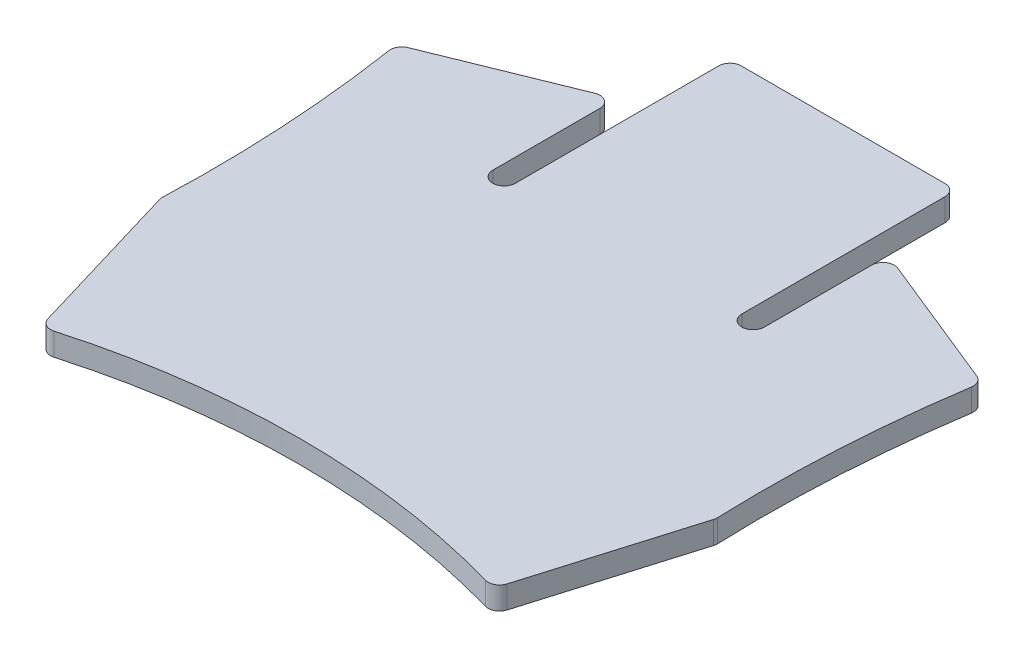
from build123d import *

# Parameters (mm, degrees)
RESSALTO_EXTRUS_O1_DEPTH = 2


with BuildPart() as part:
    # Esbo_o1 → Ressalto-extrus_o1 (new body)
    with BuildSketch(Plane(origin=(0, 0, 0), x_dir=(1, 0, 0), z_dir=(0, 1, 0))):
        with BuildLine():
            Line((9, 21.44797145), (-9, 21.44797145))
            ThreePointArc((-9, 21.44797145), (-9.707106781, 21.155078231), (-10, 20.44797145))
            Line((-10, 20.44797145), (-10, 2.4935203))
            ThreePointArc((-10, 2.4935203), (-11, 1.4935203), (-12, 2.4935203))
            Line((-12, 2.4935203), (-12, 11.963556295))
            ThreePointArc((-12, 11.963556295), (-12.441287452, 12.792917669), (-13.375680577, 12.890305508))
            Line((-13.375680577, 12.890305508), (-25.118348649, 8.130126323))
            ThreePointArc((-25.118348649, 8.130126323), (-25.611934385, 7.697721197), (-25.731213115, 7.052450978))
            ThreePointArc((-25.731213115, 7.052450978), (-24.623016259, -3.51887647), (-24.513147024, -14.147563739))
            ThreePointArc((-24.513147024, -14.147563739), (-24.505828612, -14.310453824), (-24.472135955, -14.469989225))
            Line((-24.472135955, -14.469989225), (-20.283702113, -28.518423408))
            ThreePointArc((-20.283702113, -28.518423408), (-19.807170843, -29.108999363), (-19.053198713, -29.194953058))
            ThreePointArc((-19.053198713, -29.194953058), (-9.617814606, -27.215907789), (0, -26.55202855))
            ThreePointArc((0, -26.55202855), (9.617814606, -27.215907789), (19.053198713, -29.194953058))
            ThreePointArc((19.053198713, -29.194953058), (19.807170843, -29.108999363), (20.283702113, -28.518423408))
            Line((20.283702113, -28.518423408), (24.472135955, -14.469989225))
            ThreePointArc((24.472135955, -14.469989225), (24.505828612, -14.310453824), (24.513147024, -14.147563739))
            ThreePointArc((24.513147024, -14.147563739), (24.623016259, -3.51887647), (25.731213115, 7.052450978))
            ThreePointArc((25.731213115, 7.052450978), (25.611934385, 7.697721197), (25.118348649, 8.130126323))
            Line((25.118348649, 8.130126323), (13.375680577, 12.890305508))
            ThreePointArc((13.375680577, 12.890305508), (12.441287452, 12.792917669), (12, 11.963556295))
            Line((12, 11.963556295), (12, 2.4935203))
            ThreePointArc((12, 2.4935203), (11, 1.4935203), (10, 2.4935203))
            Line((10, 2.4935203), (10, 20.44797145))
            ThreePointArc((10, 20.44797145), (9.707106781, 21.155078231), (9, 21.44797145))
        make_face()
    extrude(amount=RESSALTO_EXTRUS_O1_DEPTH)


solid = part.part
